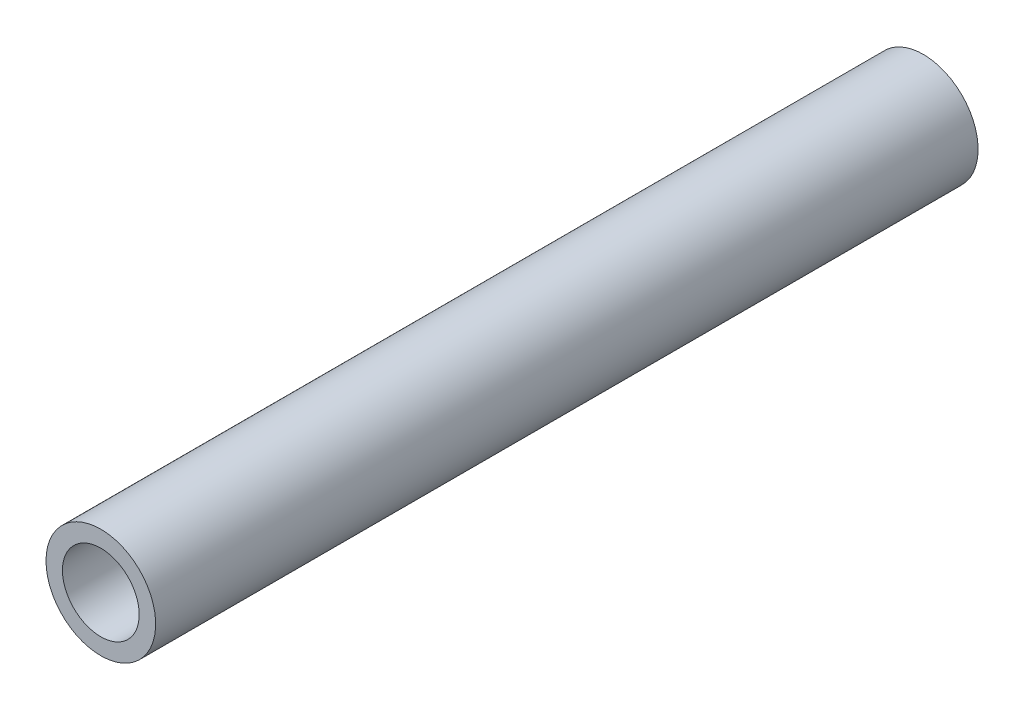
ISO-10303-21;
HEADER;
FILE_DESCRIPTION(('STEP AP214'),'2;1');
FILE_NAME('part.step','',(''),(''),'','','');
FILE_SCHEMA(('AUTOMOTIVE_DESIGN { 1 0 10303 214 1 1 1 1 }'));
ENDSEC;
DATA;
#1=APPLICATION_CONTEXT('core data for automotive mechanical design processes');
#2=APPLICATION_PROTOCOL_DEFINITION('international standard','automotive_design',2000,#1);
#3=PRODUCT_CONTEXT('',#1,'mechanical');
#4=PRODUCT('Part','Part','',(#3));
#5=PRODUCT_RELATED_PRODUCT_CATEGORY('part','',(#4));
#6=PRODUCT_DEFINITION_FORMATION('','',#4);
#7=PRODUCT_DEFINITION_CONTEXT('part definition',#1,'design');
#8=PRODUCT_DEFINITION('design','',#6,#7);
#9=PRODUCT_DEFINITION_SHAPE('','',#8);
#10=(LENGTH_UNIT() NAMED_UNIT(*) SI_UNIT(.MILLI.,.METRE.));
#11=(NAMED_UNIT(*) PLANE_ANGLE_UNIT() SI_UNIT($,.RADIAN.));
#12=(NAMED_UNIT(*) SI_UNIT($,.STERADIAN.) SOLID_ANGLE_UNIT());
#13=UNCERTAINTY_MEASURE_WITH_UNIT(LENGTH_MEASURE(1.E-05),#10,'distance_accuracy_value','');
#14=(GEOMETRIC_REPRESENTATION_CONTEXT(3) GLOBAL_UNCERTAINTY_ASSIGNED_CONTEXT((#13)) GLOBAL_UNIT_ASSIGNED_CONTEXT((#10,
#11,#12)) REPRESENTATION_CONTEXT('',''));
#15=CARTESIAN_POINT('',(0.,0.,0.));
#16=DIRECTION('',(0.,0.,1.));
#17=DIRECTION('',(1.,0.,0.));
#18=AXIS2_PLACEMENT_3D('',#15,#16,#17);
#19=CARTESIAN_POINT('',(0.,0.,22.5));
#20=DIRECTION('',(0.,0.,1.));
#21=DIRECTION('',(1.,0.,0.));
#22=AXIS2_PLACEMENT_3D('',#19,#20,#21);
#23=PLANE('',#22);
#24=CARTESIAN_POINT('',(0.,0.,22.5));
#25=DIRECTION('',(0.,0.,1.));
#26=DIRECTION('',(1.,0.,0.));
#27=AXIS2_PLACEMENT_3D('',#24,#25,#26);
#28=CIRCLE('',#27,3.);
#29=CARTESIAN_POINT('',(-3.,0.,22.5));
#30=VERTEX_POINT('',#29);
#31=EDGE_CURVE('E10',#30,#30,#28,.T.);
#32=ORIENTED_EDGE('',*,*,#31,.T.);
#33=EDGE_LOOP('',(#32));
#34=FACE_BOUND('',#33,.T.);
#35=CARTESIAN_POINT('',(0.,0.,22.5));
#36=DIRECTION('',(0.,0.,1.));
#37=DIRECTION('',(1.,0.,0.));
#38=AXIS2_PLACEMENT_3D('',#35,#36,#37);
#39=CIRCLE('',#38,2.1);
#40=CARTESIAN_POINT('',(-2.1,0.,22.5));
#41=VERTEX_POINT('',#40);
#42=EDGE_CURVE('E37',#41,#41,#39,.T.);
#43=ORIENTED_EDGE('',*,*,#42,.F.);
#44=EDGE_LOOP('',(#43));
#45=FACE_BOUND('',#44,.T.);
#46=ADVANCED_FACE('F30',(#34,#45),#23,.T.);
#47=CARTESIAN_POINT('',(0.,0.,22.5));
#48=DIRECTION('',(0.,0.,-1.));
#49=DIRECTION('',(-1.,0.,0.));
#50=AXIS2_PLACEMENT_3D('',#47,#48,#49);
#51=CYLINDRICAL_SURFACE('',#50,3.);
#52=CARTESIAN_POINT('',(0.,0.,-22.5));
#53=DIRECTION('',(0.,0.,1.));
#54=DIRECTION('',(1.,0.,0.));
#55=AXIS2_PLACEMENT_3D('',#52,#53,#54);
#56=CIRCLE('',#55,3.);
#57=CARTESIAN_POINT('',(-3.,0.,-22.5));
#58=VERTEX_POINT('',#57);
#59=EDGE_CURVE('E41',#58,#58,#56,.T.);
#60=CARTESIAN_POINT('',(-3.,0.,22.5));
#61=CARTESIAN_POINT('',(-3.,0.,22.03125));
#62=CARTESIAN_POINT('',(-3.,0.,21.5625));
#63=CARTESIAN_POINT('',(-3.,0.,20.625));
#64=CARTESIAN_POINT('',(-3.,0.,20.15625));
#65=CARTESIAN_POINT('',(-3.,0.,19.21875));
#66=CARTESIAN_POINT('',(-3.,0.,18.75));
#67=CARTESIAN_POINT('',(-3.,0.,17.8125));
#68=CARTESIAN_POINT('',(-3.,0.,17.34375));
#69=CARTESIAN_POINT('',(-3.,0.,16.40625));
#70=CARTESIAN_POINT('',(-3.,0.,15.9375));
#71=CARTESIAN_POINT('',(-3.,0.,15.));
#72=CARTESIAN_POINT('',(-3.,0.,14.53125));
#73=CARTESIAN_POINT('',(-3.,0.,13.59375));
#74=CARTESIAN_POINT('',(-3.,0.,13.125));
#75=CARTESIAN_POINT('',(-3.,0.,12.1875));
#76=CARTESIAN_POINT('',(-3.,0.,11.71875));
#77=CARTESIAN_POINT('',(-3.,0.,10.78125));
#78=CARTESIAN_POINT('',(-3.,0.,10.3125));
#79=CARTESIAN_POINT('',(-3.,0.,9.37499999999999));
#80=CARTESIAN_POINT('',(-3.,0.,8.90625));
#81=CARTESIAN_POINT('',(-3.,0.,7.96874999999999));
#82=CARTESIAN_POINT('',(-3.,0.,7.5));
#83=CARTESIAN_POINT('',(-3.,0.,6.5625));
#84=CARTESIAN_POINT('',(-3.,0.,6.09374999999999));
#85=CARTESIAN_POINT('',(-3.,0.,5.15624999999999));
#86=CARTESIAN_POINT('',(-3.,0.,4.68749999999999));
#87=CARTESIAN_POINT('',(-3.,0.,3.74999999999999));
#88=CARTESIAN_POINT('',(-3.,0.,3.28124999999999));
#89=CARTESIAN_POINT('',(-3.,0.,2.34375));
#90=CARTESIAN_POINT('',(-3.,0.,1.87499999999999));
#91=CARTESIAN_POINT('',(-3.,0.,0.937499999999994));
#92=CARTESIAN_POINT('',(-3.,0.,0.468749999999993));
#93=CARTESIAN_POINT('',(-3.,0.,-0.468750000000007));
#94=CARTESIAN_POINT('',(-3.,0.,-0.937500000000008));
#95=CARTESIAN_POINT('',(-3.,0.,-1.87500000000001));
#96=CARTESIAN_POINT('',(-3.,0.,-2.34375000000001));
#97=CARTESIAN_POINT('',(-3.,0.,-3.28125000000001));
#98=CARTESIAN_POINT('',(-3.,0.,-3.75000000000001));
#99=CARTESIAN_POINT('',(-3.,0.,-4.68750000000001));
#100=CARTESIAN_POINT('',(-3.,0.,-5.15625000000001));
#101=CARTESIAN_POINT('',(-3.,0.,-6.09375000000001));
#102=CARTESIAN_POINT('',(-3.,0.,-6.56250000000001));
#103=CARTESIAN_POINT('',(-3.,0.,-7.50000000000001));
#104=CARTESIAN_POINT('',(-3.,0.,-7.96875000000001));
#105=CARTESIAN_POINT('',(-3.,0.,-8.90625000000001));
#106=CARTESIAN_POINT('',(-3.,0.,-9.37500000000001));
#107=CARTESIAN_POINT('',(-3.,0.,-10.3125));
#108=CARTESIAN_POINT('',(-3.,0.,-10.78125));
#109=CARTESIAN_POINT('',(-3.,0.,-11.71875));
#110=CARTESIAN_POINT('',(-3.,0.,-12.1875));
#111=CARTESIAN_POINT('',(-3.,0.,-13.125));
#112=CARTESIAN_POINT('',(-3.,0.,-13.59375));
#113=CARTESIAN_POINT('',(-3.,0.,-14.53125));
#114=CARTESIAN_POINT('',(-3.,0.,-15.));
#115=CARTESIAN_POINT('',(-3.,0.,-15.9375));
#116=CARTESIAN_POINT('',(-3.,0.,-16.40625));
#117=CARTESIAN_POINT('',(-3.,0.,-17.34375));
#118=CARTESIAN_POINT('',(-3.,0.,-17.8125));
#119=CARTESIAN_POINT('',(-3.,0.,-18.75));
#120=CARTESIAN_POINT('',(-3.,0.,-19.21875));
#121=CARTESIAN_POINT('',(-3.,0.,-20.15625));
#122=CARTESIAN_POINT('',(-3.,0.,-20.625));
#123=CARTESIAN_POINT('',(-3.,0.,-21.5625));
#124=CARTESIAN_POINT('',(-3.,0.,-22.03125));
#125=CARTESIAN_POINT('',(-3.,0.,-22.5));
#126=B_SPLINE_CURVE_WITH_KNOTS('',3,(#60,#61,#62,#63,#64,#65,#66,#67,#68,#69,#70,#71,#72,#73,
#74,#75,#76,#77,#78,#79,#80,#81,#82,#83,#84,#85,#86,#87,#88,#89,#90,#91,#92,#93,#94,#95,#96,#97,
#98,#99,#100,#101,#102,#103,#104,#105,#106,#107,#108,#109,#110,#111,#112,#113,#114,#115,#116,
#117,#118,#119,#120,#121,#122,#123,#124,#125),.UNSPECIFIED.,.F.,.F.,(4,2,2,2,2,2,2,2,2,2,2,2,2,
2,2,2,2,2,2,2,2,2,2,2,2,2,2,2,2,2,2,2,4),(0.,1.40625,2.8125,4.21875,5.625,7.03125,8.4375,
9.84375,11.25,12.65625,14.0625,15.46875,16.875,18.28125,19.6875,21.09375,22.5,23.90625,25.3125,
26.71875,28.125,29.53125,30.9375,32.34375,33.75,35.15625,36.5625,37.96875,39.375,40.78125,
42.1875,43.59375,45.),.UNSPECIFIED.);
#127=EDGE_CURVE('BSEAM32',#30,#58,#126,.T.);
#128=ORIENTED_EDGE('',*,*,#31,.F.);
#129=ORIENTED_EDGE('',*,*,#59,.T.);
#130=ORIENTED_EDGE('',*,*,#127,.T.);
#131=ORIENTED_EDGE('',*,*,#127,.F.);
#132=EDGE_LOOP('',(#128,#130,#129,#131));
#133=FACE_BOUND('',#132,.T.);
#134=ADVANCED_FACE('F32',(#133),#51,.T.);
#135=CARTESIAN_POINT('',(0.,0.,22.5));
#136=DIRECTION('',(0.,0.,-1.));
#137=DIRECTION('',(-1.,0.,0.));
#138=AXIS2_PLACEMENT_3D('',#135,#136,#137);
#139=CYLINDRICAL_SURFACE('',#138,2.1);
#140=CARTESIAN_POINT('',(0.,0.,-22.5));
#141=DIRECTION('',(0.,0.,1.));
#142=DIRECTION('',(1.,0.,0.));
#143=AXIS2_PLACEMENT_3D('',#140,#141,#142);
#144=CIRCLE('',#143,2.1);
#145=CARTESIAN_POINT('',(-2.1,0.,-22.5));
#146=VERTEX_POINT('',#145);
#147=EDGE_CURVE('E45',#146,#146,#144,.T.);
#148=CARTESIAN_POINT('',(-2.1,0.,22.5));
#149=CARTESIAN_POINT('',(-2.1,0.,22.03125));
#150=CARTESIAN_POINT('',(-2.1,0.,21.5625));
#151=CARTESIAN_POINT('',(-2.1,0.,20.625));
#152=CARTESIAN_POINT('',(-2.1,0.,20.15625));
#153=CARTESIAN_POINT('',(-2.1,0.,19.21875));
#154=CARTESIAN_POINT('',(-2.1,0.,18.75));
#155=CARTESIAN_POINT('',(-2.1,0.,17.8125));
#156=CARTESIAN_POINT('',(-2.1,0.,17.34375));
#157=CARTESIAN_POINT('',(-2.1,0.,16.40625));
#158=CARTESIAN_POINT('',(-2.1,0.,15.9375));
#159=CARTESIAN_POINT('',(-2.1,0.,15.));
#160=CARTESIAN_POINT('',(-2.1,0.,14.53125));
#161=CARTESIAN_POINT('',(-2.1,0.,13.59375));
#162=CARTESIAN_POINT('',(-2.1,0.,13.125));
#163=CARTESIAN_POINT('',(-2.1,0.,12.1875));
#164=CARTESIAN_POINT('',(-2.1,0.,11.71875));
#165=CARTESIAN_POINT('',(-2.1,0.,10.78125));
#166=CARTESIAN_POINT('',(-2.1,0.,10.3125));
#167=CARTESIAN_POINT('',(-2.1,0.,9.37499999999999));
#168=CARTESIAN_POINT('',(-2.1,0.,8.90625));
#169=CARTESIAN_POINT('',(-2.1,0.,7.96874999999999));
#170=CARTESIAN_POINT('',(-2.1,0.,7.5));
#171=CARTESIAN_POINT('',(-2.1,0.,6.5625));
#172=CARTESIAN_POINT('',(-2.1,0.,6.09375));
#173=CARTESIAN_POINT('',(-2.1,0.,5.15625));
#174=CARTESIAN_POINT('',(-2.1,0.,4.6875));
#175=CARTESIAN_POINT('',(-2.1,0.,3.75));
#176=CARTESIAN_POINT('',(-2.1,0.,3.28125));
#177=CARTESIAN_POINT('',(-2.1,0.,2.34375));
#178=CARTESIAN_POINT('',(-2.1,0.,1.875));
#179=CARTESIAN_POINT('',(-2.1,0.,0.937499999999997));
#180=CARTESIAN_POINT('',(-2.1,0.,0.468749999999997));
#181=CARTESIAN_POINT('',(-2.1,0.,-0.468750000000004));
#182=CARTESIAN_POINT('',(-2.1,0.,-0.937500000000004));
#183=CARTESIAN_POINT('',(-2.1,0.,-1.87500000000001));
#184=CARTESIAN_POINT('',(-2.1,0.,-2.34375000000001));
#185=CARTESIAN_POINT('',(-2.1,0.,-3.28125));
#186=CARTESIAN_POINT('',(-2.1,0.,-3.75));
#187=CARTESIAN_POINT('',(-2.1,0.,-4.6875));
#188=CARTESIAN_POINT('',(-2.1,0.,-5.15625));
#189=CARTESIAN_POINT('',(-2.1,0.,-6.09375000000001));
#190=CARTESIAN_POINT('',(-2.1,0.,-6.56250000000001));
#191=CARTESIAN_POINT('',(-2.1,0.,-7.50000000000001));
#192=CARTESIAN_POINT('',(-2.1,0.,-7.96875000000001));
#193=CARTESIAN_POINT('',(-2.1,0.,-8.90625));
#194=CARTESIAN_POINT('',(-2.1,0.,-9.37500000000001));
#195=CARTESIAN_POINT('',(-2.1,0.,-10.3125));
#196=CARTESIAN_POINT('',(-2.1,0.,-10.78125));
#197=CARTESIAN_POINT('',(-2.1,0.,-11.71875));
#198=CARTESIAN_POINT('',(-2.1,0.,-12.1875));
#199=CARTESIAN_POINT('',(-2.1,0.,-13.125));
#200=CARTESIAN_POINT('',(-2.1,0.,-13.59375));
#201=CARTESIAN_POINT('',(-2.1,0.,-14.53125));
#202=CARTESIAN_POINT('',(-2.1,0.,-15.));
#203=CARTESIAN_POINT('',(-2.1,0.,-15.9375));
#204=CARTESIAN_POINT('',(-2.1,0.,-16.40625));
#205=CARTESIAN_POINT('',(-2.1,0.,-17.34375));
#206=CARTESIAN_POINT('',(-2.1,0.,-17.8125));
#207=CARTESIAN_POINT('',(-2.1,0.,-18.75));
#208=CARTESIAN_POINT('',(-2.1,0.,-19.21875));
#209=CARTESIAN_POINT('',(-2.1,0.,-20.15625));
#210=CARTESIAN_POINT('',(-2.1,0.,-20.625));
#211=CARTESIAN_POINT('',(-2.1,0.,-21.5625));
#212=CARTESIAN_POINT('',(-2.1,0.,-22.03125));
#213=CARTESIAN_POINT('',(-2.1,0.,-22.5));
#214=B_SPLINE_CURVE_WITH_KNOTS('',3,(#148,#149,#150,#151,#152,#153,#154,#155,#156,#157,#158,
#159,#160,#161,#162,#163,#164,#165,#166,#167,#168,#169,#170,#171,#172,#173,#174,#175,#176,#177,
#178,#179,#180,#181,#182,#183,#184,#185,#186,#187,#188,#189,#190,#191,#192,#193,#194,#195,#196,
#197,#198,#199,#200,#201,#202,#203,#204,#205,#206,#207,#208,#209,#210,#211,#212,#213),
.UNSPECIFIED.,.F.,.F.,(4,2,2,2,2,2,2,2,2,2,2,2,2,2,2,2,2,2,2,2,2,2,2,2,2,2,2,2,2,2,2,2,4),(0.,
1.40625,2.8125,4.21875,5.625,7.03125,8.4375,9.84375,11.25,12.65625,14.0625,15.46875,16.875,
18.28125,19.6875,21.09375,22.5,23.90625,25.3125,26.71875,28.125,29.53125,30.9375,32.34375,33.75,
35.15625,36.5625,37.96875,39.375,40.78125,42.1875,43.59375,45.),.UNSPECIFIED.);
#215=EDGE_CURVE('BSEAM54',#41,#146,#214,.T.);
#216=ORIENTED_EDGE('',*,*,#42,.T.);
#217=ORIENTED_EDGE('',*,*,#147,.F.);
#218=ORIENTED_EDGE('',*,*,#215,.T.);
#219=ORIENTED_EDGE('',*,*,#215,.F.);
#220=EDGE_LOOP('',(#216,#218,#217,#219));
#221=FACE_BOUND('',#220,.T.);
#222=ADVANCED_FACE('F54',(#221),#139,.F.);
#223=CARTESIAN_POINT('',(0.,0.,-22.5));
#224=DIRECTION('',(0.,0.,1.));
#225=DIRECTION('',(1.,0.,0.));
#226=AXIS2_PLACEMENT_3D('',#223,#224,#225);
#227=PLANE('',#226);
#228=ORIENTED_EDGE('',*,*,#147,.T.);
#229=EDGE_LOOP('',(#228));
#230=FACE_BOUND('',#229,.T.);
#231=ORIENTED_EDGE('',*,*,#59,.F.);
#232=EDGE_LOOP('',(#231));
#233=FACE_BOUND('',#232,.T.);
#234=ADVANCED_FACE('F51',(#230,#233),#227,.F.);
#235=CLOSED_SHELL('',(#46,#134,#222,#234));
#236=MANIFOLD_SOLID_BREP('B2',#235);
#237=ADVANCED_BREP_SHAPE_REPRESENTATION('',(#18,#236),#14);
#238=SHAPE_DEFINITION_REPRESENTATION(#9,#237);
ENDSEC;
END-ISO-10303-21;
